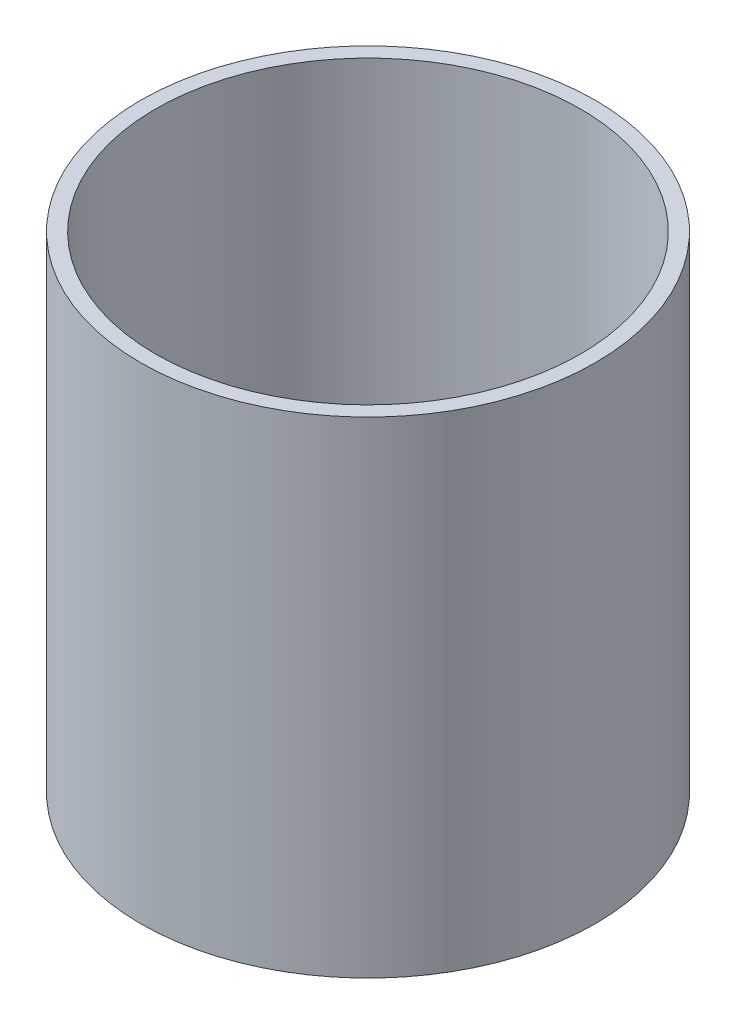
ISO-10303-21;
HEADER;
FILE_DESCRIPTION(('STEP AP214'),'2;1');
FILE_NAME('part.step','',(''),(''),'','','');
FILE_SCHEMA(('AUTOMOTIVE_DESIGN { 1 0 10303 214 1 1 1 1 }'));
ENDSEC;
DATA;
#1=APPLICATION_CONTEXT('core data for automotive mechanical design processes');
#2=APPLICATION_PROTOCOL_DEFINITION('international standard','automotive_design',2000,#1);
#3=PRODUCT_CONTEXT('',#1,'mechanical');
#4=PRODUCT('Part','Part','',(#3));
#5=PRODUCT_RELATED_PRODUCT_CATEGORY('part','',(#4));
#6=PRODUCT_DEFINITION_FORMATION('','',#4);
#7=PRODUCT_DEFINITION_CONTEXT('part definition',#1,'design');
#8=PRODUCT_DEFINITION('design','',#6,#7);
#9=PRODUCT_DEFINITION_SHAPE('','',#8);
#10=(LENGTH_UNIT() NAMED_UNIT(*) SI_UNIT(.MILLI.,.METRE.));
#11=(NAMED_UNIT(*) PLANE_ANGLE_UNIT() SI_UNIT($,.RADIAN.));
#12=(NAMED_UNIT(*) SI_UNIT($,.STERADIAN.) SOLID_ANGLE_UNIT());
#13=UNCERTAINTY_MEASURE_WITH_UNIT(LENGTH_MEASURE(1.E-05),#10,'distance_accuracy_value','');
#14=(GEOMETRIC_REPRESENTATION_CONTEXT(3) GLOBAL_UNCERTAINTY_ASSIGNED_CONTEXT((#13)) GLOBAL_UNIT_ASSIGNED_CONTEXT((#10,
#11,#12)) REPRESENTATION_CONTEXT('',''));
#15=CARTESIAN_POINT('',(0.,0.,0.));
#16=DIRECTION('',(0.,0.,1.));
#17=DIRECTION('',(1.,0.,0.));
#18=AXIS2_PLACEMENT_3D('',#15,#16,#17);
#19=CARTESIAN_POINT('',(0.,177.8,0.));
#20=DIRECTION('',(0.,1.,0.));
#21=DIRECTION('',(0.,0.,1.));
#22=AXIS2_PLACEMENT_3D('',#19,#20,#21);
#23=PLANE('',#22);
#24=CARTESIAN_POINT('',(0.,177.8,0.));
#25=DIRECTION('',(0.,1.,0.));
#26=DIRECTION('',(0.,0.,1.));
#27=AXIS2_PLACEMENT_3D('',#24,#25,#26);
#28=CIRCLE('',#27,83.185);
#29=CARTESIAN_POINT('',(0.,177.8,83.185));
#30=VERTEX_POINT('',#29);
#31=EDGE_CURVE('E10',#30,#30,#28,.T.);
#32=ORIENTED_EDGE('',*,*,#31,.T.);
#33=EDGE_LOOP('',(#32));
#34=FACE_BOUND('',#33,.T.);
#35=CARTESIAN_POINT('',(0.,177.8,0.));
#36=DIRECTION('',(0.,1.,0.));
#37=DIRECTION('',(0.,0.,1.));
#38=AXIS2_PLACEMENT_3D('',#35,#36,#37);
#39=CIRCLE('',#38,77.724);
#40=CARTESIAN_POINT('',(0.,177.8,77.724));
#41=VERTEX_POINT('',#40);
#42=EDGE_CURVE('E42',#41,#41,#39,.T.);
#43=ORIENTED_EDGE('',*,*,#42,.F.);
#44=EDGE_LOOP('',(#43));
#45=FACE_BOUND('',#44,.T.);
#46=ADVANCED_FACE('F31',(#34,#45),#23,.T.);
#47=CARTESIAN_POINT('',(0.,0.,0.));
#48=DIRECTION('',(0.,1.,0.));
#49=DIRECTION('',(0.,0.,1.));
#50=AXIS2_PLACEMENT_3D('',#47,#48,#49);
#51=PLANE('',#50);
#52=CARTESIAN_POINT('',(0.,0.,0.));
#53=DIRECTION('',(0.,1.,0.));
#54=DIRECTION('',(0.,0.,1.));
#55=AXIS2_PLACEMENT_3D('',#52,#53,#54);
#56=CIRCLE('',#55,83.185);
#57=CARTESIAN_POINT('',(0.,0.,83.185));
#58=VERTEX_POINT('',#57);
#59=EDGE_CURVE('E35',#58,#58,#56,.T.);
#60=ORIENTED_EDGE('',*,*,#59,.F.);
#61=EDGE_LOOP('',(#60));
#62=FACE_BOUND('',#61,.T.);
#63=CARTESIAN_POINT('',(0.,0.,0.));
#64=DIRECTION('',(0.,1.,0.));
#65=DIRECTION('',(0.,0.,1.));
#66=AXIS2_PLACEMENT_3D('',#63,#64,#65);
#67=CIRCLE('',#66,77.724);
#68=CARTESIAN_POINT('',(0.,0.,77.724));
#69=VERTEX_POINT('',#68);
#70=EDGE_CURVE('E44',#69,#69,#67,.T.);
#71=ORIENTED_EDGE('',*,*,#70,.T.);
#72=EDGE_LOOP('',(#71));
#73=FACE_BOUND('',#72,.T.);
#74=ADVANCED_FACE('F54',(#62,#73),#51,.F.);
#75=CARTESIAN_POINT('',(0.,177.8,0.));
#76=DIRECTION('',(0.,-1.,0.));
#77=DIRECTION('',(0.,0.,-1.));
#78=AXIS2_PLACEMENT_3D('',#75,#76,#77);
#79=CYLINDRICAL_SURFACE('',#78,83.185);
#80=ORIENTED_EDGE('',*,*,#31,.F.);
#81=EDGE_LOOP('',(#80));
#82=FACE_BOUND('',#81,.T.);
#83=ORIENTED_EDGE('',*,*,#59,.T.);
#84=EDGE_LOOP('',(#83));
#85=FACE_BOUND('',#84,.T.);
#86=ADVANCED_FACE('F33',(#82,#85),#79,.T.);
#87=CARTESIAN_POINT('',(0.,177.8,0.));
#88=DIRECTION('',(0.,-1.,0.));
#89=DIRECTION('',(0.,0.,-1.));
#90=AXIS2_PLACEMENT_3D('',#87,#88,#89);
#91=CYLINDRICAL_SURFACE('',#90,77.724);
#92=ORIENTED_EDGE('',*,*,#42,.T.);
#93=EDGE_LOOP('',(#92));
#94=FACE_BOUND('',#93,.T.);
#95=ORIENTED_EDGE('',*,*,#70,.F.);
#96=EDGE_LOOP('',(#95));
#97=FACE_BOUND('',#96,.T.);
#98=ADVANCED_FACE('F50',(#94,#97),#91,.F.);
#99=CLOSED_SHELL('',(#46,#74,#86,#98));
#100=MANIFOLD_SOLID_BREP('B2',#99);
#101=ADVANCED_BREP_SHAPE_REPRESENTATION('',(#18,#100),#14);
#102=SHAPE_DEFINITION_REPRESENTATION(#9,#101);
ENDSEC;
END-ISO-10303-21;
